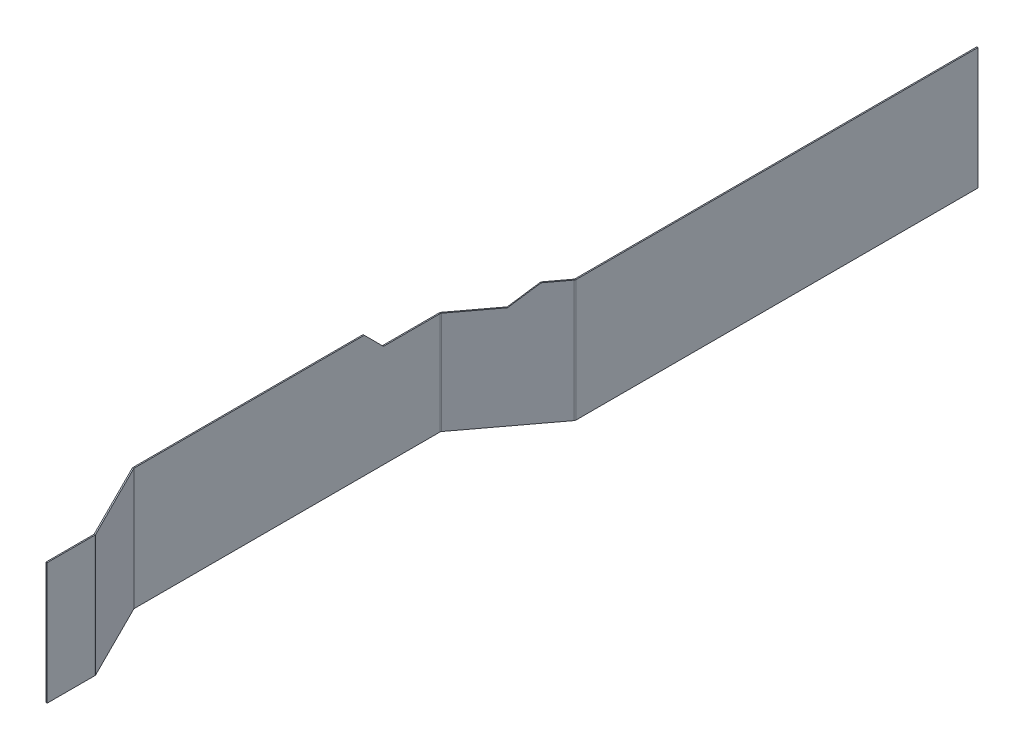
ISO-10303-21;
HEADER;
FILE_DESCRIPTION(('STEP AP214'),'2;1');
FILE_NAME('part.step','',(''),(''),'','','');
FILE_SCHEMA(('AUTOMOTIVE_DESIGN { 1 0 10303 214 1 1 1 1 }'));
ENDSEC;
DATA;
#1=APPLICATION_CONTEXT('core data for automotive mechanical design processes');
#2=APPLICATION_PROTOCOL_DEFINITION('international standard','automotive_design',2000,#1);
#3=PRODUCT_CONTEXT('',#1,'mechanical');
#4=PRODUCT('Part','Part','',(#3));
#5=PRODUCT_RELATED_PRODUCT_CATEGORY('part','',(#4));
#6=PRODUCT_DEFINITION_FORMATION('','',#4);
#7=PRODUCT_DEFINITION_CONTEXT('part definition',#1,'design');
#8=PRODUCT_DEFINITION('design','',#6,#7);
#9=PRODUCT_DEFINITION_SHAPE('','',#8);
#10=(LENGTH_UNIT() NAMED_UNIT(*) SI_UNIT(.MILLI.,.METRE.));
#11=(NAMED_UNIT(*) PLANE_ANGLE_UNIT() SI_UNIT($,.RADIAN.));
#12=(NAMED_UNIT(*) SI_UNIT($,.STERADIAN.) SOLID_ANGLE_UNIT());
#13=UNCERTAINTY_MEASURE_WITH_UNIT(LENGTH_MEASURE(1.E-05),#10,'distance_accuracy_value','');
#14=(GEOMETRIC_REPRESENTATION_CONTEXT(3) GLOBAL_UNCERTAINTY_ASSIGNED_CONTEXT((#13)) GLOBAL_UNIT_ASSIGNED_CONTEXT((#10,
#11,#12)) REPRESENTATION_CONTEXT('',''));
#15=CARTESIAN_POINT('',(0.,0.,0.));
#16=DIRECTION('',(0.,0.,1.));
#17=DIRECTION('',(1.,0.,0.));
#18=AXIS2_PLACEMENT_3D('',#15,#16,#17);
#19=CARTESIAN_POINT('',(-130.059115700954,162.314236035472,-50.1060746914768));
#20=DIRECTION('',(0.,1.,0.));
#21=DIRECTION('',(0.,0.,1.));
#22=AXIS2_PLACEMENT_3D('',#19,#20,#21);
#23=PLANE('',#22);
#24=DIRECTION('',(0.,0.,-1.));
#25=VECTOR('',#24,1.);
#26=CARTESIAN_POINT('',(-128.535115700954,162.314236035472,-50.1060746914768));
#27=LINE('',#26,#25);
#28=CARTESIAN_POINT('',(-128.535115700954,162.314236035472,-48.5820746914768));
#29=VERTEX_POINT('',#28);
#30=CARTESIAN_POINT('',(-128.535115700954,162.314236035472,482.625058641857));
#31=VERTEX_POINT('',#30);
#32=EDGE_CURVE('E200',#29,#31,#27,.F.);
#33=ORIENTED_EDGE('',*,*,#32,.F.);
#34=DIRECTION('',(-1.,0.,0.));
#35=VECTOR('',#34,1.);
#36=CARTESIAN_POINT('',(-130.059115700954,162.314236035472,-48.5820746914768));
#37=LINE('',#36,#35);
#38=CARTESIAN_POINT('',(-130.059115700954,162.314236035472,-48.5820746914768));
#39=VERTEX_POINT('',#38);
#40=EDGE_CURVE('E54',#29,#39,#37,.T.);
#41=ORIENTED_EDGE('',*,*,#40,.T.);
#42=DIRECTION('',(0.,0.,1.));
#43=VECTOR('',#42,1.);
#44=CARTESIAN_POINT('',(-130.059115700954,162.314236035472,-50.1060746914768));
#45=LINE('',#44,#43);
#46=CARTESIAN_POINT('',(-130.059115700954,162.314236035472,482.625058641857));
#47=VERTEX_POINT('',#46);
#48=EDGE_CURVE('E61',#39,#47,#45,.T.);
#49=ORIENTED_EDGE('',*,*,#48,.T.);
#50=DIRECTION('',(-1.,0.,0.));
#51=VECTOR('',#50,1.);
#52=CARTESIAN_POINT('',(-130.059115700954,162.314236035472,482.625058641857));
#53=LINE('',#52,#51);
#54=EDGE_CURVE('E265',#31,#47,#53,.T.);
#55=ORIENTED_EDGE('',*,*,#54,.F.);
#56=EDGE_LOOP('',(#33,#41,#49,#55));
#57=FACE_BOUND('',#56,.T.);
#58=ADVANCED_FACE('F39',(#57),#23,.T.);
#59=CARTESIAN_POINT('',(-130.059115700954,1.45603603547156,-50.1060746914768));
#60=DIRECTION('',(0.,1.,0.));
#61=DIRECTION('',(0.,0.,1.));
#62=AXIS2_PLACEMENT_3D('',#59,#60,#61);
#63=PLANE('',#62);
#64=DIRECTION('',(0.,0.,1.));
#65=VECTOR('',#64,1.);
#66=CARTESIAN_POINT('',(-130.059115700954,1.45603603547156,-50.1060746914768));
#67=LINE('',#66,#65);
#68=CARTESIAN_POINT('',(-130.059115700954,1.45603603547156,-48.5820746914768));
#69=VERTEX_POINT('',#68);
#70=CARTESIAN_POINT('',(-130.059115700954,1.45603603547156,482.625058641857));
#71=VERTEX_POINT('',#70);
#72=EDGE_CURVE('E417',#69,#71,#67,.T.);
#73=ORIENTED_EDGE('',*,*,#72,.F.);
#74=DIRECTION('',(-1.,0.,0.));
#75=VECTOR('',#74,1.);
#76=CARTESIAN_POINT('',(-130.059115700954,1.45603603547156,-48.5820746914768));
#77=LINE('',#76,#75);
#78=CARTESIAN_POINT('',(-128.535115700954,1.45603603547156,-48.5820746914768));
#79=VERTEX_POINT('',#78);
#80=EDGE_CURVE('E420',#69,#79,#77,.F.);
#81=ORIENTED_EDGE('',*,*,#80,.T.);
#82=DIRECTION('',(0.,0.,-1.));
#83=VECTOR('',#82,1.);
#84=CARTESIAN_POINT('',(-128.535115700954,1.45603603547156,-50.1060746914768));
#85=LINE('',#84,#83);
#86=CARTESIAN_POINT('',(-128.535115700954,1.45603603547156,482.625058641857));
#87=VERTEX_POINT('',#86);
#88=EDGE_CURVE('E212',#79,#87,#85,.F.);
#89=ORIENTED_EDGE('',*,*,#88,.T.);
#90=DIRECTION('',(-1.,0.,0.));
#91=VECTOR('',#90,1.);
#92=CARTESIAN_POINT('',(-130.059115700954,1.45603603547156,482.625058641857));
#93=LINE('',#92,#91);
#94=EDGE_CURVE('E262',#87,#71,#93,.T.);
#95=ORIENTED_EDGE('',*,*,#94,.T.);
#96=EDGE_LOOP('',(#73,#81,#89,#95));
#97=FACE_BOUND('',#96,.T.);
#98=ADVANCED_FACE('F414',(#97),#63,.F.);
#99=CARTESIAN_POINT('',(-130.059115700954,162.314236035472,-50.1060746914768));
#100=DIRECTION('',(1.,0.,0.));
#101=DIRECTION('',(0.,0.,-1.));
#102=AXIS2_PLACEMENT_3D('',#99,#100,#101);
#103=PLANE('',#102);
#104=DIRECTION('',(0.,1.,0.));
#105=VECTOR('',#104,1.);
#106=CARTESIAN_POINT('',(-130.059115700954,162.314236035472,-48.5820746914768));
#107=LINE('',#106,#105);
#108=EDGE_CURVE('E211',#69,#39,#107,.T.);
#109=ORIENTED_EDGE('',*,*,#108,.F.);
#110=ORIENTED_EDGE('',*,*,#72,.T.);
#111=DIRECTION('',(0.,-1.,0.));
#112=VECTOR('',#111,1.);
#113=CARTESIAN_POINT('',(-130.059115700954,162.314236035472,482.625058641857));
#114=LINE('',#113,#112);
#115=EDGE_CURVE('E151',#71,#47,#114,.F.);
#116=ORIENTED_EDGE('',*,*,#115,.T.);
#117=ORIENTED_EDGE('',*,*,#48,.F.);
#118=EDGE_LOOP('',(#109,#110,#116,#117));
#119=FACE_BOUND('',#118,.T.);
#120=ADVANCED_FACE('F557',(#119),#103,.F.);
#121=CARTESIAN_POINT('',(-128.535115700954,162.314236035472,-50.1060746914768));
#122=DIRECTION('',(1.,0.,0.));
#123=DIRECTION('',(0.,0.,-1.));
#124=AXIS2_PLACEMENT_3D('',#121,#122,#123);
#125=PLANE('',#124);
#126=ORIENTED_EDGE('',*,*,#88,.F.);
#127=DIRECTION('',(0.,1.,0.));
#128=VECTOR('',#127,1.);
#129=CARTESIAN_POINT('',(-128.535115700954,162.314236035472,-48.5820746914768));
#130=LINE('',#129,#128);
#131=EDGE_CURVE('E11',#79,#29,#130,.T.);
#132=ORIENTED_EDGE('',*,*,#131,.T.);
#133=ORIENTED_EDGE('',*,*,#32,.T.);
#134=DIRECTION('',(0.,1.,0.));
#135=VECTOR('',#134,1.);
#136=CARTESIAN_POINT('',(-128.535115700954,162.314236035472,482.625058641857));
#137=LINE('',#136,#135);
#138=EDGE_CURVE('E181',#87,#31,#137,.T.);
#139=ORIENTED_EDGE('',*,*,#138,.F.);
#140=EDGE_LOOP('',(#126,#132,#133,#139));
#141=FACE_BOUND('',#140,.T.);
#142=ADVANCED_FACE('F421',(#141),#125,.T.);
#143=CARTESIAN_POINT('',(-206.259115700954,162.314236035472,991.293925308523));
#144=DIRECTION('',(0.,1.,0.));
#145=DIRECTION('',(0.447213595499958,0.,0.894427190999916));
#146=AXIS2_PLACEMENT_3D('',#143,#144,#145);
#147=PLANE('',#146);
#148=DIRECTION('',(-0.894427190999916,0.,0.447213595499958));
#149=VECTOR('',#148,1.);
#150=CARTESIAN_POINT('',(-155.670958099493,162.314236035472,1092.47024051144));
#151=LINE('',#150,#149);
#152=CARTESIAN_POINT('',(-154.30785106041,162.314236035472,1091.7886869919));
#153=VERTEX_POINT('',#152);
#154=CARTESIAN_POINT('',(-155.670958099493,162.314236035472,1092.47024051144));
#155=VERTEX_POINT('',#154);
#156=EDGE_CURVE('E47',#153,#155,#151,.T.);
#157=ORIENTED_EDGE('',*,*,#156,.F.);
#158=DIRECTION('',(-0.447213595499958,0.,-0.894427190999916));
#159=VECTOR('',#158,1.);
#160=CARTESIAN_POINT('',(-204.89600866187,162.314236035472,990.612371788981));
#161=LINE('',#160,#159);
#162=CARTESIAN_POINT('',(-204.523273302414,162.314236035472,991.357842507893));
#163=VERTEX_POINT('',#162);
#164=EDGE_CURVE('E185',#163,#153,#161,.F.);
#165=ORIENTED_EDGE('',*,*,#164,.F.);
#166=DIRECTION('',(-0.894427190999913,0.,0.447213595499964));
#167=VECTOR('',#166,1.);
#168=CARTESIAN_POINT('',(-205.886380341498,162.314236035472,992.039396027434));
#169=LINE('',#168,#167);
#170=CARTESIAN_POINT('',(-205.886380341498,162.314236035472,992.039396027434));
#171=VERTEX_POINT('',#170);
#172=EDGE_CURVE('E291',#163,#171,#169,.T.);
#173=ORIENTED_EDGE('',*,*,#172,.T.);
#174=DIRECTION('',(0.447213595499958,0.,0.894427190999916));
#175=VECTOR('',#174,1.);
#176=CARTESIAN_POINT('',(-206.259115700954,162.314236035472,991.293925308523));
#177=LINE('',#176,#175);
#178=EDGE_CURVE('E314',#171,#155,#177,.T.);
#179=ORIENTED_EDGE('',*,*,#178,.T.);
#180=EDGE_LOOP('',(#157,#165,#173,#179));
#181=FACE_BOUND('',#180,.T.);
#182=ADVANCED_FACE('F315',(#181),#147,.T.);
#183=CARTESIAN_POINT('',(-202.728515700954,162.314236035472,990.460463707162));
#184=DIRECTION('',(0.,-1.,0.));
#185=DIRECTION('',(0.,0.,-1.));
#186=AXIS2_PLACEMENT_3D('',#183,#184,#185);
#187=PLANE('',#186);
#188=ORIENTED_EDGE('',*,*,#172,.F.);
#189=CARTESIAN_POINT('',(-202.728515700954,162.314236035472,990.460463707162));
#190=DIRECTION('',(0.,-1.,0.));
#191=DIRECTION('',(0.,0.,-1.));
#192=AXIS2_PLACEMENT_3D('',#189,#190,#191);
#193=CIRCLE('',#192,2.0066);
#194=CARTESIAN_POINT('',(-204.735115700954,162.314236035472,990.460463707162));
#195=VERTEX_POINT('',#194);
#196=EDGE_CURVE('E187',#163,#195,#193,.T.);
#197=ORIENTED_EDGE('',*,*,#196,.T.);
#198=DIRECTION('',(-1.,0.,0.));
#199=VECTOR('',#198,1.);
#200=CARTESIAN_POINT('',(-206.259115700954,162.314236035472,990.460463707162));
#201=LINE('',#200,#199);
#202=CARTESIAN_POINT('',(-206.259115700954,162.314236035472,990.460463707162));
#203=VERTEX_POINT('',#202);
#204=EDGE_CURVE('E288',#195,#203,#201,.T.);
#205=ORIENTED_EDGE('',*,*,#204,.T.);
#206=CARTESIAN_POINT('',(-202.728515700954,162.314236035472,990.460463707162));
#207=DIRECTION('',(0.,1.,0.));
#208=DIRECTION('',(0.,0.,1.));
#209=AXIS2_PLACEMENT_3D('',#206,#207,#208);
#210=CIRCLE('',#209,3.5306);
#211=EDGE_CURVE('E335',#171,#203,#210,.F.);
#212=ORIENTED_EDGE('',*,*,#211,.F.);
#213=EDGE_LOOP('',(#188,#197,#205,#212));
#214=FACE_BOUND('',#213,.T.);
#215=ADVANCED_FACE('F596',(#214),#187,.F.);
#216=CARTESIAN_POINT('',(-206.259115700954,162.314236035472,584.893925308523));
#217=DIRECTION('',(0.,1.,0.));
#218=DIRECTION('',(0.,0.,1.));
#219=AXIS2_PLACEMENT_3D('',#216,#217,#218);
#220=PLANE('',#219);
#221=ORIENTED_EDGE('',*,*,#204,.F.);
#222=DIRECTION('',(0.,0.,-1.));
#223=VECTOR('',#222,1.);
#224=CARTESIAN_POINT('',(-204.735115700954,162.314236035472,584.893925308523));
#225=LINE('',#224,#223);
#226=CARTESIAN_POINT('',(-204.735115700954,162.314236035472,686.493925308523));
#227=VERTEX_POINT('',#226);
#228=EDGE_CURVE('E199',#227,#195,#225,.F.);
#229=ORIENTED_EDGE('',*,*,#228,.F.);
#230=DIRECTION('',(-1.,0.,0.));
#231=VECTOR('',#230,1.);
#232=CARTESIAN_POINT('',(-206.259115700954,162.314236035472,686.493925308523));
#233=LINE('',#232,#231);
#234=CARTESIAN_POINT('',(-206.259115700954,162.314236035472,686.493925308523));
#235=VERTEX_POINT('',#234);
#236=EDGE_CURVE('E285',#227,#235,#233,.T.);
#237=ORIENTED_EDGE('',*,*,#236,.T.);
#238=DIRECTION('',(0.,0.,1.));
#239=VECTOR('',#238,1.);
#240=CARTESIAN_POINT('',(-206.259115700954,162.314236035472,584.893925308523));
#241=LINE('',#240,#239);
#242=EDGE_CURVE('E488',#235,#203,#241,.T.);
#243=ORIENTED_EDGE('',*,*,#242,.T.);
#244=EDGE_LOOP('',(#221,#229,#237,#243));
#245=FACE_BOUND('',#244,.T.);
#246=ADVANCED_FACE('F545',(#245),#220,.T.);
#247=CARTESIAN_POINT('',(-206.259115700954,194.278178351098,718.45786762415));
#248=DIRECTION('',(0.,-0.707106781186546,0.707106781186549));
#249=DIRECTION('',(0.,-0.707106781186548,-0.707106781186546));
#250=AXIS2_PLACEMENT_3D('',#247,#248,#249);
#251=PLANE('',#250);
#252=ORIENTED_EDGE('',*,*,#236,.F.);
#253=DIRECTION('',(0.,-0.707106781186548,-0.707106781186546));
#254=VECTOR('',#253,1.);
#255=CARTESIAN_POINT('',(-204.735115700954,194.278178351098,718.45786762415));
#256=LINE('',#255,#254);
#257=CARTESIAN_POINT('',(-204.735115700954,136.914236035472,661.093925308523));
#258=VERTEX_POINT('',#257);
#259=EDGE_CURVE('E229',#227,#258,#256,.T.);
#260=ORIENTED_EDGE('',*,*,#259,.T.);
#261=DIRECTION('',(-1.,0.,0.));
#262=VECTOR('',#261,1.);
#263=CARTESIAN_POINT('',(-206.259115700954,136.914236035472,661.093925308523));
#264=LINE('',#263,#262);
#265=CARTESIAN_POINT('',(-206.259115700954,136.914236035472,661.093925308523));
#266=VERTEX_POINT('',#265);
#267=EDGE_CURVE('E282',#258,#266,#264,.T.);
#268=ORIENTED_EDGE('',*,*,#267,.T.);
#269=DIRECTION('',(0.,-0.707106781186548,-0.707106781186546));
#270=VECTOR('',#269,1.);
#271=CARTESIAN_POINT('',(-206.259115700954,194.278178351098,718.45786762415));
#272=LINE('',#271,#270);
#273=EDGE_CURVE('E497',#235,#266,#272,.T.);
#274=ORIENTED_EDGE('',*,*,#273,.F.);
#275=EDGE_LOOP('',(#252,#260,#268,#274));
#276=FACE_BOUND('',#275,.T.);
#277=ADVANCED_FACE('F542',(#276),#251,.F.);
#278=CARTESIAN_POINT('',(-206.259115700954,136.914236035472,661.093925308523));
#279=DIRECTION('',(0.,-1.,0.));
#280=DIRECTION('',(0.,0.,-1.));
#281=AXIS2_PLACEMENT_3D('',#278,#279,#280);
#282=PLANE('',#281);
#283=ORIENTED_EDGE('',*,*,#267,.F.);
#284=DIRECTION('',(0.,0.,-1.));
#285=VECTOR('',#284,1.);
#286=CARTESIAN_POINT('',(-204.735115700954,136.914236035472,584.893925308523));
#287=LINE('',#286,#285);
#288=CARTESIAN_POINT('',(-204.735115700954,136.914236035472,586.07079197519));
#289=VERTEX_POINT('',#288);
#290=EDGE_CURVE('E191',#258,#289,#287,.T.);
#291=ORIENTED_EDGE('',*,*,#290,.T.);
#292=DIRECTION('',(-1.,0.,0.));
#293=VECTOR('',#292,1.);
#294=CARTESIAN_POINT('',(-206.259115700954,136.914236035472,586.07079197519));
#295=LINE('',#294,#293);
#296=CARTESIAN_POINT('',(-206.259115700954,136.914236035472,586.07079197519));
#297=VERTEX_POINT('',#296);
#298=EDGE_CURVE('E279',#289,#297,#295,.T.);
#299=ORIENTED_EDGE('',*,*,#298,.T.);
#300=DIRECTION('',(0.,0.,-1.));
#301=VECTOR('',#300,1.);
#302=CARTESIAN_POINT('',(-206.259115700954,136.914236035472,661.093925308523));
#303=LINE('',#302,#301);
#304=EDGE_CURVE('E494',#266,#297,#303,.T.);
#305=ORIENTED_EDGE('',*,*,#304,.F.);
#306=EDGE_LOOP('',(#283,#291,#299,#305));
#307=FACE_BOUND('',#306,.T.);
#308=ADVANCED_FACE('F538',(#307),#282,.F.);
#309=CARTESIAN_POINT('',(-202.728515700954,136.914236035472,586.07079197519));
#310=DIRECTION('',(0.,-1.,0.));
#311=DIRECTION('',(0.,0.,-1.));
#312=AXIS2_PLACEMENT_3D('',#309,#310,#311);
#313=PLANE('',#312);
#314=ORIENTED_EDGE('',*,*,#298,.F.);
#315=CARTESIAN_POINT('',(-202.728515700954,136.914236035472,586.07079197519));
#316=DIRECTION('',(0.,-1.,0.));
#317=DIRECTION('',(0.,0.,-1.));
#318=AXIS2_PLACEMENT_3D('',#315,#316,#317);
#319=CIRCLE('',#318,2.0066);
#320=CARTESIAN_POINT('',(-204.333795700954,136.914236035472,584.86683197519));
#321=VERTEX_POINT('',#320);
#322=EDGE_CURVE('E195',#289,#321,#319,.T.);
#323=ORIENTED_EDGE('',*,*,#322,.T.);
#324=DIRECTION('',(-0.8,0.,-0.6));
#325=VECTOR('',#324,1.);
#326=CARTESIAN_POINT('',(-205.552995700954,136.914236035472,583.95243197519));
#327=LINE('',#326,#325);
#328=CARTESIAN_POINT('',(-205.552995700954,136.914236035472,583.95243197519));
#329=VERTEX_POINT('',#328);
#330=EDGE_CURVE('E276',#321,#329,#327,.T.);
#331=ORIENTED_EDGE('',*,*,#330,.T.);
#332=CARTESIAN_POINT('',(-202.728515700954,136.914236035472,586.07079197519));
#333=DIRECTION('',(0.,1.,0.));
#334=DIRECTION('',(0.,0.,1.));
#335=AXIS2_PLACEMENT_3D('',#332,#333,#334);
#336=CIRCLE('',#335,3.5306);
#337=EDGE_CURVE('E343',#297,#329,#336,.F.);
#338=ORIENTED_EDGE('',*,*,#337,.F.);
#339=EDGE_LOOP('',(#314,#323,#331,#338));
#340=FACE_BOUND('',#339,.T.);
#341=ADVANCED_FACE('F458',(#340),#313,.F.);
#342=CARTESIAN_POINT('',(-130.059115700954,136.914236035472,483.293925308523));
#343=DIRECTION('',(0.,-1.,0.));
#344=DIRECTION('',(0.6,0.,-0.8));
#345=AXIS2_PLACEMENT_3D('',#342,#343,#344);
#346=PLANE('',#345);
#347=ORIENTED_EDGE('',*,*,#330,.F.);
#348=DIRECTION('',(0.6,0.,-0.8));
#349=VECTOR('',#348,1.);
#350=CARTESIAN_POINT('',(-128.839915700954,136.914236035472,484.208325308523));
#351=LINE('',#350,#349);
#352=CARTESIAN_POINT('',(-166.939915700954,136.914236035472,535.008325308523));
#353=VERTEX_POINT('',#352);
#354=EDGE_CURVE('E207',#321,#353,#351,.T.);
#355=ORIENTED_EDGE('',*,*,#354,.T.);
#356=DIRECTION('',(-0.8,0.,-0.6));
#357=VECTOR('',#356,1.);
#358=CARTESIAN_POINT('',(-168.159115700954,136.914236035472,534.093925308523));
#359=LINE('',#358,#357);
#360=CARTESIAN_POINT('',(-168.159115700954,136.914236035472,534.093925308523));
#361=VERTEX_POINT('',#360);
#362=EDGE_CURVE('E273',#353,#361,#359,.T.);
#363=ORIENTED_EDGE('',*,*,#362,.T.);
#364=DIRECTION('',(0.6,0.,-0.8));
#365=VECTOR('',#364,1.);
#366=CARTESIAN_POINT('',(-130.059115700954,136.914236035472,483.293925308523));
#367=LINE('',#366,#365);
#368=EDGE_CURVE('E467',#329,#361,#367,.T.);
#369=ORIENTED_EDGE('',*,*,#368,.F.);
#370=EDGE_LOOP('',(#347,#355,#363,#369));
#371=FACE_BOUND('',#370,.T.);
#372=ADVANCED_FACE('F468',(#371),#346,.F.);
#373=CARTESIAN_POINT('',(-137.493262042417,177.80204091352,493.206120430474));
#374=DIRECTION('',(0.374817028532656,-0.780868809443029,-0.499756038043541));
#375=DIRECTION('',(0.468521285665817,0.624695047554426,-0.624695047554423));
#376=AXIS2_PLACEMENT_3D('',#373,#374,#375);
#377=PLANE('',#376);
#378=ORIENTED_EDGE('',*,*,#362,.F.);
#379=DIRECTION('',(0.468521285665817,0.624695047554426,-0.624695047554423));
#380=VECTOR('',#379,1.);
#381=CARTESIAN_POINT('',(-136.274062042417,177.80204091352,494.120520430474));
#382=LINE('',#381,#380);
#383=CARTESIAN_POINT('',(-147.889915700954,162.314236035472,509.608325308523));
#384=VERTEX_POINT('',#383);
#385=EDGE_CURVE('E220',#353,#384,#382,.T.);
#386=ORIENTED_EDGE('',*,*,#385,.T.);
#387=DIRECTION('',(-0.8,0.,-0.6));
#388=VECTOR('',#387,1.);
#389=CARTESIAN_POINT('',(-149.109115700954,162.314236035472,508.693925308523));
#390=LINE('',#389,#388);
#391=CARTESIAN_POINT('',(-149.109115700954,162.314236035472,508.693925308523));
#392=VERTEX_POINT('',#391);
#393=EDGE_CURVE('E270',#384,#392,#390,.T.);
#394=ORIENTED_EDGE('',*,*,#393,.T.);
#395=DIRECTION('',(0.468521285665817,0.624695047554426,-0.624695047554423));
#396=VECTOR('',#395,1.);
#397=CARTESIAN_POINT('',(-137.493262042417,177.80204091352,493.206120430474));
#398=LINE('',#397,#396);
#399=EDGE_CURVE('E472',#361,#392,#398,.T.);
#400=ORIENTED_EDGE('',*,*,#399,.F.);
#401=EDGE_LOOP('',(#378,#386,#394,#400));
#402=FACE_BOUND('',#401,.T.);
#403=ADVANCED_FACE('F582',(#402),#377,.F.);
#404=CARTESIAN_POINT('',(-130.059115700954,162.314236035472,483.293925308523));
#405=DIRECTION('',(0.,1.,0.));
#406=DIRECTION('',(-0.6,0.,0.8));
#407=AXIS2_PLACEMENT_3D('',#404,#405,#406);
#408=PLANE('',#407);
#409=ORIENTED_EDGE('',*,*,#393,.F.);
#410=DIRECTION('',(0.6,0.,-0.8));
#411=VECTOR('',#410,1.);
#412=CARTESIAN_POINT('',(-128.839915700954,162.314236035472,484.208325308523));
#413=LINE('',#412,#411);
#414=CARTESIAN_POINT('',(-129.241235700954,162.314236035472,484.743418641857));
#415=VERTEX_POINT('',#414);
#416=EDGE_CURVE('E214',#415,#384,#413,.F.);
#417=ORIENTED_EDGE('',*,*,#416,.F.);
#418=DIRECTION('',(-0.799999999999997,0.,-0.600000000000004));
#419=VECTOR('',#418,1.);
#420=CARTESIAN_POINT('',(-130.460435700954,162.314236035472,483.829018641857));
#421=LINE('',#420,#419);
#422=CARTESIAN_POINT('',(-130.460435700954,162.314236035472,483.829018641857));
#423=VERTEX_POINT('',#422);
#424=EDGE_CURVE('E267',#415,#423,#421,.T.);
#425=ORIENTED_EDGE('',*,*,#424,.T.);
#426=DIRECTION('',(-0.6,0.,0.8));
#427=VECTOR('',#426,1.);
#428=CARTESIAN_POINT('',(-130.059115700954,162.314236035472,483.293925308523));
#429=LINE('',#428,#427);
#430=EDGE_CURVE('E550',#423,#392,#429,.T.);
#431=ORIENTED_EDGE('',*,*,#430,.T.);
#432=EDGE_LOOP('',(#409,#417,#425,#431));
#433=FACE_BOUND('',#432,.T.);
#434=ADVANCED_FACE('F579',(#433),#408,.T.);
#435=CARTESIAN_POINT('',(-132.065715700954,162.314236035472,482.625058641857));
#436=DIRECTION('',(0.,1.,0.));
#437=DIRECTION('',(0.,0.,1.));
#438=AXIS2_PLACEMENT_3D('',#435,#436,#437);
#439=PLANE('',#438);
#440=ORIENTED_EDGE('',*,*,#424,.F.);
#441=CARTESIAN_POINT('',(-132.065715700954,162.314236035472,482.625058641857));
#442=DIRECTION('',(0.,1.,0.));
#443=DIRECTION('',(0.,0.,1.));
#444=AXIS2_PLACEMENT_3D('',#441,#442,#443);
#445=CIRCLE('',#444,3.5306);
#446=EDGE_CURVE('E204',#415,#31,#445,.T.);
#447=ORIENTED_EDGE('',*,*,#446,.T.);
#448=ORIENTED_EDGE('',*,*,#54,.T.);
#449=CARTESIAN_POINT('',(-132.065715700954,162.314236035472,482.625058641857));
#450=DIRECTION('',(0.,-1.,0.));
#451=DIRECTION('',(0.,0.,-1.));
#452=AXIS2_PLACEMENT_3D('',#449,#450,#451);
#453=CIRCLE('',#452,2.0066);
#454=EDGE_CURVE('E355',#423,#47,#453,.F.);
#455=ORIENTED_EDGE('',*,*,#454,.F.);
#456=EDGE_LOOP('',(#440,#447,#448,#455));
#457=FACE_BOUND('',#456,.T.);
#458=ADVANCED_FACE('F393',(#457),#439,.T.);
#459=CARTESIAN_POINT('',(-132.065715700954,1.45603603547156,482.625058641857));
#460=DIRECTION('',(0.,-1.,0.));
#461=DIRECTION('',(0.,0.,-1.));
#462=AXIS2_PLACEMENT_3D('',#459,#460,#461);
#463=PLANE('',#462);
#464=ORIENTED_EDGE('',*,*,#94,.F.);
#465=CARTESIAN_POINT('',(-132.065715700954,1.45603603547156,482.625058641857));
#466=DIRECTION('',(0.,1.,0.));
#467=DIRECTION('',(0.,0.,1.));
#468=AXIS2_PLACEMENT_3D('',#465,#466,#467);
#469=CIRCLE('',#468,3.5306);
#470=CARTESIAN_POINT('',(-129.241235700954,1.45603603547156,484.743418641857));
#471=VERTEX_POINT('',#470);
#472=EDGE_CURVE('E208',#87,#471,#469,.F.);
#473=ORIENTED_EDGE('',*,*,#472,.T.);
#474=DIRECTION('',(-0.8,0.,-0.6));
#475=VECTOR('',#474,1.);
#476=CARTESIAN_POINT('',(-130.460435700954,1.45603603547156,483.829018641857));
#477=LINE('',#476,#475);
#478=CARTESIAN_POINT('',(-130.460435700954,1.45603603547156,483.829018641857));
#479=VERTEX_POINT('',#478);
#480=EDGE_CURVE('E259',#471,#479,#477,.T.);
#481=ORIENTED_EDGE('',*,*,#480,.T.);
#482=CARTESIAN_POINT('',(-132.065715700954,1.45603603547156,482.625058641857));
#483=DIRECTION('',(0.,1.,0.));
#484=DIRECTION('',(0.,0.,1.));
#485=AXIS2_PLACEMENT_3D('',#482,#483,#484);
#486=CIRCLE('',#485,2.0066);
#487=EDGE_CURVE('E362',#71,#479,#486,.F.);
#488=ORIENTED_EDGE('',*,*,#487,.F.);
#489=EDGE_LOOP('',(#464,#473,#481,#488));
#490=FACE_BOUND('',#489,.T.);
#491=ADVANCED_FACE('F408',(#490),#463,.T.);
#492=CARTESIAN_POINT('',(-130.059115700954,1.45603603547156,483.293925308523));
#493=DIRECTION('',(0.,1.,0.));
#494=DIRECTION('',(-0.6,0.,0.8));
#495=AXIS2_PLACEMENT_3D('',#492,#493,#494);
#496=PLANE('',#495);
#497=ORIENTED_EDGE('',*,*,#480,.F.);
#498=DIRECTION('',(0.6,0.,-0.8));
#499=VECTOR('',#498,1.);
#500=CARTESIAN_POINT('',(-128.839915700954,1.45603603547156,484.208325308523));
#501=LINE('',#500,#499);
#502=CARTESIAN_POINT('',(-204.333795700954,1.45603603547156,584.86683197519));
#503=VERTEX_POINT('',#502);
#504=EDGE_CURVE('E171',#471,#503,#501,.F.);
#505=ORIENTED_EDGE('',*,*,#504,.T.);
#506=DIRECTION('',(-0.800000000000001,0.,-0.599999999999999));
#507=VECTOR('',#506,1.);
#508=CARTESIAN_POINT('',(-205.552995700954,1.45603603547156,583.95243197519));
#509=LINE('',#508,#507);
#510=CARTESIAN_POINT('',(-205.552995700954,1.45603603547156,583.95243197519));
#511=VERTEX_POINT('',#510);
#512=EDGE_CURVE('E256',#503,#511,#509,.T.);
#513=ORIENTED_EDGE('',*,*,#512,.T.);
#514=DIRECTION('',(-0.6,0.,0.8));
#515=VECTOR('',#514,1.);
#516=CARTESIAN_POINT('',(-130.059115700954,1.45603603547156,483.293925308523));
#517=LINE('',#516,#515);
#518=EDGE_CURVE('E310',#479,#511,#517,.T.);
#519=ORIENTED_EDGE('',*,*,#518,.F.);
#520=EDGE_LOOP('',(#497,#505,#513,#519));
#521=FACE_BOUND('',#520,.T.);
#522=ADVANCED_FACE('F638',(#521),#496,.F.);
#523=CARTESIAN_POINT('',(-202.728515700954,1.45603603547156,586.07079197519));
#524=DIRECTION('',(0.,1.,0.));
#525=DIRECTION('',(0.,0.,1.));
#526=AXIS2_PLACEMENT_3D('',#523,#524,#525);
#527=PLANE('',#526);
#528=ORIENTED_EDGE('',*,*,#512,.F.);
#529=CARTESIAN_POINT('',(-202.728515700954,1.45603603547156,586.07079197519));
#530=DIRECTION('',(0.,-1.,0.));
#531=DIRECTION('',(0.,0.,-1.));
#532=AXIS2_PLACEMENT_3D('',#529,#530,#531);
#533=CIRCLE('',#532,2.0066);
#534=CARTESIAN_POINT('',(-204.735115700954,1.45603603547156,586.07079197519));
#535=VERTEX_POINT('',#534);
#536=EDGE_CURVE('E201',#503,#535,#533,.F.);
#537=ORIENTED_EDGE('',*,*,#536,.T.);
#538=DIRECTION('',(-1.,0.,0.));
#539=VECTOR('',#538,1.);
#540=CARTESIAN_POINT('',(-206.259115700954,1.45603603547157,586.07079197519));
#541=LINE('',#540,#539);
#542=CARTESIAN_POINT('',(-206.259115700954,1.45603603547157,586.07079197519));
#543=VERTEX_POINT('',#542);
#544=EDGE_CURVE('E253',#535,#543,#541,.T.);
#545=ORIENTED_EDGE('',*,*,#544,.T.);
#546=CARTESIAN_POINT('',(-202.728515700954,1.45603603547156,586.07079197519));
#547=DIRECTION('',(0.,-1.,0.));
#548=DIRECTION('',(0.,0.,-1.));
#549=AXIS2_PLACEMENT_3D('',#546,#547,#548);
#550=CIRCLE('',#549,3.5306);
#551=EDGE_CURVE('E352',#511,#543,#550,.F.);
#552=ORIENTED_EDGE('',*,*,#551,.F.);
#553=EDGE_LOOP('',(#528,#537,#545,#552));
#554=FACE_BOUND('',#553,.T.);
#555=ADVANCED_FACE('F480',(#554),#527,.F.);
#556=CARTESIAN_POINT('',(-206.259115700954,1.45603603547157,-50.1060746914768));
#557=DIRECTION('',(0.,1.,0.));
#558=DIRECTION('',(0.,0.,1.));
#559=AXIS2_PLACEMENT_3D('',#556,#557,#558);
#560=PLANE('',#559);
#561=ORIENTED_EDGE('',*,*,#544,.F.);
#562=DIRECTION('',(0.,0.,-1.));
#563=VECTOR('',#562,1.);
#564=CARTESIAN_POINT('',(-204.735115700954,1.45603603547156,584.893925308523));
#565=LINE('',#564,#563);
#566=CARTESIAN_POINT('',(-204.735115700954,1.45603603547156,990.460463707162));
#567=VERTEX_POINT('',#566);
#568=EDGE_CURVE('E196',#535,#567,#565,.F.);
#569=ORIENTED_EDGE('',*,*,#568,.T.);
#570=DIRECTION('',(-1.,0.,0.));
#571=VECTOR('',#570,1.);
#572=CARTESIAN_POINT('',(-206.259115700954,1.45603603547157,990.460463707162));
#573=LINE('',#572,#571);
#574=CARTESIAN_POINT('',(-206.259115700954,1.45603603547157,990.460463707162));
#575=VERTEX_POINT('',#574);
#576=EDGE_CURVE('E250',#567,#575,#573,.T.);
#577=ORIENTED_EDGE('',*,*,#576,.T.);
#578=DIRECTION('',(0.,0.,1.));
#579=VECTOR('',#578,1.);
#580=CARTESIAN_POINT('',(-206.259115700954,1.45603603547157,-50.1060746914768));
#581=LINE('',#580,#579);
#582=EDGE_CURVE('E484',#543,#575,#581,.T.);
#583=ORIENTED_EDGE('',*,*,#582,.F.);
#584=EDGE_LOOP('',(#561,#569,#577,#583));
#585=FACE_BOUND('',#584,.T.);
#586=ADVANCED_FACE('F485',(#585),#560,.F.);
#587=CARTESIAN_POINT('',(-202.728515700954,1.45603603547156,990.460463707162));
#588=DIRECTION('',(0.,1.,0.));
#589=DIRECTION('',(0.,0.,1.));
#590=AXIS2_PLACEMENT_3D('',#587,#588,#589);
#591=PLANE('',#590);
#592=ORIENTED_EDGE('',*,*,#576,.F.);
#593=CARTESIAN_POINT('',(-202.728515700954,1.45603603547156,990.460463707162));
#594=DIRECTION('',(0.,-1.,0.));
#595=DIRECTION('',(0.,0.,-1.));
#596=AXIS2_PLACEMENT_3D('',#593,#594,#595);
#597=CIRCLE('',#596,2.0066);
#598=CARTESIAN_POINT('',(-204.523273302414,1.45603603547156,991.357842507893));
#599=VERTEX_POINT('',#598);
#600=EDGE_CURVE('E192',#567,#599,#597,.F.);
#601=ORIENTED_EDGE('',*,*,#600,.T.);
#602=DIRECTION('',(-0.894427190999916,0.,0.447213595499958));
#603=VECTOR('',#602,1.);
#604=CARTESIAN_POINT('',(-205.886380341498,1.45603603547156,992.039396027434));
#605=LINE('',#604,#603);
#606=CARTESIAN_POINT('',(-205.886380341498,1.45603603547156,992.039396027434));
#607=VERTEX_POINT('',#606);
#608=EDGE_CURVE('E247',#599,#607,#605,.T.);
#609=ORIENTED_EDGE('',*,*,#608,.T.);
#610=CARTESIAN_POINT('',(-202.728515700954,1.45603603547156,990.460463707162));
#611=DIRECTION('',(0.,-1.,0.));
#612=DIRECTION('',(0.,0.,-1.));
#613=AXIS2_PLACEMENT_3D('',#610,#611,#612);
#614=CIRCLE('',#613,3.5306);
#615=EDGE_CURVE('E340',#575,#607,#614,.F.);
#616=ORIENTED_EDGE('',*,*,#615,.F.);
#617=EDGE_LOOP('',(#592,#601,#609,#616));
#618=FACE_BOUND('',#617,.T.);
#619=ADVANCED_FACE('F527',(#618),#591,.F.);
#620=CARTESIAN_POINT('',(-206.259115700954,1.45603603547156,991.293925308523));
#621=DIRECTION('',(0.,1.,0.));
#622=DIRECTION('',(0.447213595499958,0.,0.894427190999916));
#623=AXIS2_PLACEMENT_3D('',#620,#621,#622);
#624=PLANE('',#623);
#625=ORIENTED_EDGE('',*,*,#608,.F.);
#626=DIRECTION('',(-0.447213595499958,0.,-0.894427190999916));
#627=VECTOR('',#626,1.);
#628=CARTESIAN_POINT('',(-204.89600866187,1.45603603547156,990.612371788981));
#629=LINE('',#628,#627);
#630=CARTESIAN_POINT('',(-154.30785106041,1.45603603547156,1091.7886869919));
#631=VERTEX_POINT('',#630);
#632=EDGE_CURVE('E188',#599,#631,#629,.F.);
#633=ORIENTED_EDGE('',*,*,#632,.T.);
#634=DIRECTION('',(-0.894427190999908,0.,0.447213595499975));
#635=VECTOR('',#634,1.);
#636=CARTESIAN_POINT('',(-155.670958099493,1.45603603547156,1092.47024051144));
#637=LINE('',#636,#635);
#638=CARTESIAN_POINT('',(-155.670958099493,1.45603603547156,1092.47024051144));
#639=VERTEX_POINT('',#638);
#640=EDGE_CURVE('E244',#631,#639,#637,.T.);
#641=ORIENTED_EDGE('',*,*,#640,.T.);
#642=DIRECTION('',(0.447213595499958,0.,0.894427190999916));
#643=VECTOR('',#642,1.);
#644=CARTESIAN_POINT('',(-206.259115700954,1.45603603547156,991.293925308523));
#645=LINE('',#644,#643);
#646=EDGE_CURVE('E321',#607,#639,#645,.T.);
#647=ORIENTED_EDGE('',*,*,#646,.F.);
#648=EDGE_LOOP('',(#625,#633,#641,#647));
#649=FACE_BOUND('',#648,.T.);
#650=ADVANCED_FACE('F520',(#649),#624,.F.);
#651=CARTESIAN_POINT('',(-157.465715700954,1.45603603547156,1093.36761931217));
#652=DIRECTION('',(0.,-1.,0.));
#653=DIRECTION('',(0.,0.,-1.));
#654=AXIS2_PLACEMENT_3D('',#651,#652,#653);
#655=PLANE('',#654);
#656=ORIENTED_EDGE('',*,*,#640,.F.);
#657=CARTESIAN_POINT('',(-157.465715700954,1.45603603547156,1093.36761931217));
#658=DIRECTION('',(0.,1.,0.));
#659=DIRECTION('',(0.,0.,1.));
#660=AXIS2_PLACEMENT_3D('',#657,#658,#659);
#661=CIRCLE('',#660,3.5306);
#662=CARTESIAN_POINT('',(-153.935115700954,1.45603603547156,1093.36761931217));
#663=VERTEX_POINT('',#662);
#664=EDGE_CURVE('E172',#631,#663,#661,.F.);
#665=ORIENTED_EDGE('',*,*,#664,.T.);
#666=DIRECTION('',(-1.,0.,0.));
#667=VECTOR('',#666,1.);
#668=CARTESIAN_POINT('',(-155.459115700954,1.45603603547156,1093.36761931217));
#669=LINE('',#668,#667);
#670=CARTESIAN_POINT('',(-155.459115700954,1.45603603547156,1093.36761931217));
#671=VERTEX_POINT('',#670);
#672=EDGE_CURVE('E241',#663,#671,#669,.T.);
#673=ORIENTED_EDGE('',*,*,#672,.T.);
#674=CARTESIAN_POINT('',(-157.465715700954,1.45603603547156,1093.36761931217));
#675=DIRECTION('',(0.,1.,0.));
#676=DIRECTION('',(0.,0.,1.));
#677=AXIS2_PLACEMENT_3D('',#674,#675,#676);
#678=CIRCLE('',#677,2.0066);
#679=EDGE_CURVE('E311',#639,#671,#678,.F.);
#680=ORIENTED_EDGE('',*,*,#679,.F.);
#681=EDGE_LOOP('',(#656,#665,#673,#680));
#682=FACE_BOUND('',#681,.T.);
#683=ADVANCED_FACE('F517',(#682),#655,.T.);
#684=CARTESIAN_POINT('',(-155.459115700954,1.45603603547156,1092.89392530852));
#685=DIRECTION('',(0.,1.,0.));
#686=DIRECTION('',(0.,0.,1.));
#687=AXIS2_PLACEMENT_3D('',#684,#685,#686);
#688=PLANE('',#687);
#689=ORIENTED_EDGE('',*,*,#672,.F.);
#690=DIRECTION('',(0.,0.,-1.));
#691=VECTOR('',#690,1.);
#692=CARTESIAN_POINT('',(-153.935115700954,1.45603603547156,1092.89392530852));
#693=LINE('',#692,#691);
#694=CARTESIAN_POINT('',(-153.935115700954,1.45603603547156,1156.39392530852));
#695=VERTEX_POINT('',#694);
#696=EDGE_CURVE('E161',#663,#695,#693,.F.);
#697=ORIENTED_EDGE('',*,*,#696,.T.);
#698=DIRECTION('',(-1.,0.,0.));
#699=VECTOR('',#698,1.);
#700=CARTESIAN_POINT('',(-155.459115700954,1.45603603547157,1156.39392530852));
#701=LINE('',#700,#699);
#702=CARTESIAN_POINT('',(-155.459115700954,1.45603603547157,1156.39392530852));
#703=VERTEX_POINT('',#702);
#704=EDGE_CURVE('E238',#695,#703,#701,.T.);
#705=ORIENTED_EDGE('',*,*,#704,.T.);
#706=DIRECTION('',(0.,0.,1.));
#707=VECTOR('',#706,1.);
#708=CARTESIAN_POINT('',(-155.459115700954,1.45603603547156,1092.89392530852));
#709=LINE('',#708,#707);
#710=EDGE_CURVE('E320',#671,#703,#709,.T.);
#711=ORIENTED_EDGE('',*,*,#710,.F.);
#712=EDGE_LOOP('',(#689,#697,#705,#711));
#713=FACE_BOUND('',#712,.T.);
#714=ADVANCED_FACE('F515',(#713),#688,.F.);
#715=CARTESIAN_POINT('',(-155.459115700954,162.314236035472,1156.39392530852));
#716=DIRECTION('',(0.,0.,1.));
#717=DIRECTION('',(0.,-1.,0.));
#718=AXIS2_PLACEMENT_3D('',#715,#716,#717);
#719=PLANE('',#718);
#720=ORIENTED_EDGE('',*,*,#704,.F.);
#721=DIRECTION('',(0.,1.,0.));
#722=VECTOR('',#721,1.);
#723=CARTESIAN_POINT('',(-153.935115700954,162.314236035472,1156.39392530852));
#724=LINE('',#723,#722);
#725=CARTESIAN_POINT('',(-153.935115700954,162.314236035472,1156.39392530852));
#726=VERTEX_POINT('',#725);
#727=EDGE_CURVE('E177',#726,#695,#724,.F.);
#728=ORIENTED_EDGE('',*,*,#727,.F.);
#729=DIRECTION('',(-1.,0.,0.));
#730=VECTOR('',#729,1.);
#731=CARTESIAN_POINT('',(-155.459115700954,162.314236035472,1156.39392530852));
#732=LINE('',#731,#730);
#733=CARTESIAN_POINT('',(-155.459115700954,162.314236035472,1156.39392530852));
#734=VERTEX_POINT('',#733);
#735=EDGE_CURVE('E150',#726,#734,#732,.T.);
#736=ORIENTED_EDGE('',*,*,#735,.T.);
#737=DIRECTION('',(0.,-1.,0.));
#738=VECTOR('',#737,1.);
#739=CARTESIAN_POINT('',(-155.459115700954,162.314236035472,1156.39392530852));
#740=LINE('',#739,#738);
#741=EDGE_CURVE('E506',#734,#703,#740,.T.);
#742=ORIENTED_EDGE('',*,*,#741,.T.);
#743=EDGE_LOOP('',(#720,#728,#736,#742));
#744=FACE_BOUND('',#743,.T.);
#745=ADVANCED_FACE('F513',(#744),#719,.T.);
#746=CARTESIAN_POINT('',(-155.459115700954,162.314236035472,1092.89392530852));
#747=DIRECTION('',(0.,1.,0.));
#748=DIRECTION('',(0.,0.,1.));
#749=AXIS2_PLACEMENT_3D('',#746,#747,#748);
#750=PLANE('',#749);
#751=ORIENTED_EDGE('',*,*,#735,.F.);
#752=DIRECTION('',(0.,0.,-1.));
#753=VECTOR('',#752,1.);
#754=CARTESIAN_POINT('',(-153.935115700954,162.314236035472,1092.89392530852));
#755=LINE('',#754,#753);
#756=CARTESIAN_POINT('',(-153.935115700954,162.314236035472,1093.36761931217));
#757=VERTEX_POINT('',#756);
#758=EDGE_CURVE('E159',#757,#726,#755,.F.);
#759=ORIENTED_EDGE('',*,*,#758,.F.);
#760=DIRECTION('',(-1.,0.,0.));
#761=VECTOR('',#760,1.);
#762=CARTESIAN_POINT('',(-155.459115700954,162.314236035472,1093.36761931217));
#763=LINE('',#762,#761);
#764=CARTESIAN_POINT('',(-155.459115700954,162.314236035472,1093.36761931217));
#765=VERTEX_POINT('',#764);
#766=EDGE_CURVE('E138',#757,#765,#763,.T.);
#767=ORIENTED_EDGE('',*,*,#766,.T.);
#768=DIRECTION('',(0.,0.,1.));
#769=VECTOR('',#768,1.);
#770=CARTESIAN_POINT('',(-155.459115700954,162.314236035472,1092.89392530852));
#771=LINE('',#770,#769);
#772=EDGE_CURVE('E331',#765,#734,#771,.T.);
#773=ORIENTED_EDGE('',*,*,#772,.T.);
#774=EDGE_LOOP('',(#751,#759,#767,#773));
#775=FACE_BOUND('',#774,.T.);
#776=ADVANCED_FACE('F174',(#775),#750,.T.);
#777=CARTESIAN_POINT('',(-157.465715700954,162.314236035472,1093.36761931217));
#778=DIRECTION('',(0.,1.,0.));
#779=DIRECTION('',(0.,0.,1.));
#780=AXIS2_PLACEMENT_3D('',#777,#778,#779);
#781=PLANE('',#780);
#782=CARTESIAN_POINT('',(-157.465715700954,162.314236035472,1093.36761931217));
#783=DIRECTION('',(0.,1.,0.));
#784=DIRECTION('',(0.,0.,1.));
#785=AXIS2_PLACEMENT_3D('',#782,#783,#784);
#786=CIRCLE('',#785,3.5306);
#787=EDGE_CURVE('E142',#757,#153,#786,.T.);
#788=ORIENTED_EDGE('',*,*,#787,.T.);
#789=ORIENTED_EDGE('',*,*,#156,.T.);
#790=CARTESIAN_POINT('',(-157.465715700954,162.314236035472,1093.36761931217));
#791=DIRECTION('',(0.,-1.,0.));
#792=DIRECTION('',(0.,0.,-1.));
#793=AXIS2_PLACEMENT_3D('',#790,#791,#792);
#794=CIRCLE('',#793,2.0066);
#795=EDGE_CURVE('E145',#765,#155,#794,.F.);
#796=ORIENTED_EDGE('',*,*,#795,.F.);
#797=ORIENTED_EDGE('',*,*,#766,.F.);
#798=EDGE_LOOP('',(#788,#789,#796,#797));
#799=FACE_BOUND('',#798,.T.);
#800=ADVANCED_FACE('F41',(#799),#781,.T.);
#801=CARTESIAN_POINT('',(-155.459115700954,162.314236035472,1092.89392530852));
#802=DIRECTION('',(1.,0.,0.));
#803=DIRECTION('',(0.,0.,-1.));
#804=AXIS2_PLACEMENT_3D('',#801,#802,#803);
#805=PLANE('',#804);
#806=ORIENTED_EDGE('',*,*,#772,.F.);
#807=DIRECTION('',(0.,-1.,0.));
#808=VECTOR('',#807,1.);
#809=CARTESIAN_POINT('',(-155.459115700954,1.45603603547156,1093.36761931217));
#810=LINE('',#809,#808);
#811=EDGE_CURVE('E309',#765,#671,#810,.T.);
#812=ORIENTED_EDGE('',*,*,#811,.T.);
#813=ORIENTED_EDGE('',*,*,#710,.T.);
#814=ORIENTED_EDGE('',*,*,#741,.F.);
#815=EDGE_LOOP('',(#806,#812,#813,#814));
#816=FACE_BOUND('',#815,.T.);
#817=ADVANCED_FACE('F510',(#816),#805,.F.);
#818=CARTESIAN_POINT('',(-206.259115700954,162.314236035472,991.293925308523));
#819=DIRECTION('',(0.894427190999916,0.,-0.447213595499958));
#820=DIRECTION('',(-0.447213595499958,0.,-0.894427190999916));
#821=AXIS2_PLACEMENT_3D('',#818,#819,#820);
#822=PLANE('',#821);
#823=ORIENTED_EDGE('',*,*,#178,.F.);
#824=DIRECTION('',(0.,-1.,0.));
#825=VECTOR('',#824,1.);
#826=CARTESIAN_POINT('',(-205.886380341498,162.314236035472,992.039396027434));
#827=LINE('',#826,#825);
#828=EDGE_CURVE('E327',#171,#607,#827,.T.);
#829=ORIENTED_EDGE('',*,*,#828,.T.);
#830=ORIENTED_EDGE('',*,*,#646,.T.);
#831=DIRECTION('',(0.,-1.,0.));
#832=VECTOR('',#831,1.);
#833=CARTESIAN_POINT('',(-155.670958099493,162.314236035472,1092.47024051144));
#834=LINE('',#833,#832);
#835=EDGE_CURVE('E307',#639,#155,#834,.F.);
#836=ORIENTED_EDGE('',*,*,#835,.T.);
#837=EDGE_LOOP('',(#823,#829,#830,#836));
#838=FACE_BOUND('',#837,.T.);
#839=ADVANCED_FACE('F324',(#838),#822,.F.);
#840=CARTESIAN_POINT('',(-206.259115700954,162.314236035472,584.893925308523));
#841=DIRECTION('',(1.,0.,0.));
#842=DIRECTION('',(0.,0.,-1.));
#843=AXIS2_PLACEMENT_3D('',#840,#841,#842);
#844=PLANE('',#843);
#845=ORIENTED_EDGE('',*,*,#304,.T.);
#846=DIRECTION('',(0.,-1.,0.));
#847=VECTOR('',#846,1.);
#848=CARTESIAN_POINT('',(-206.259115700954,162.314236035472,586.07079197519));
#849=LINE('',#848,#847);
#850=EDGE_CURVE('E339',#297,#543,#849,.T.);
#851=ORIENTED_EDGE('',*,*,#850,.T.);
#852=ORIENTED_EDGE('',*,*,#582,.T.);
#853=DIRECTION('',(0.,-1.,0.));
#854=VECTOR('',#853,1.);
#855=CARTESIAN_POINT('',(-206.259115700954,162.314236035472,990.460463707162));
#856=LINE('',#855,#854);
#857=EDGE_CURVE('E329',#575,#203,#856,.F.);
#858=ORIENTED_EDGE('',*,*,#857,.T.);
#859=ORIENTED_EDGE('',*,*,#242,.F.);
#860=ORIENTED_EDGE('',*,*,#273,.T.);
#861=EDGE_LOOP('',(#845,#851,#852,#858,#859,#860));
#862=FACE_BOUND('',#861,.T.);
#863=ADVANCED_FACE('F491',(#862),#844,.F.);
#864=CARTESIAN_POINT('',(-130.059115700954,162.314236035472,483.293925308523));
#865=DIRECTION('',(0.8,0.,0.6));
#866=DIRECTION('',(0.6,0.,-0.8));
#867=AXIS2_PLACEMENT_3D('',#864,#865,#866);
#868=PLANE('',#867);
#869=ORIENTED_EDGE('',*,*,#430,.F.);
#870=DIRECTION('',(0.,-1.,0.));
#871=VECTOR('',#870,1.);
#872=CARTESIAN_POINT('',(-130.460435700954,1.45603603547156,483.829018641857));
#873=LINE('',#872,#871);
#874=EDGE_CURVE('E351',#423,#479,#873,.T.);
#875=ORIENTED_EDGE('',*,*,#874,.T.);
#876=ORIENTED_EDGE('',*,*,#518,.T.);
#877=DIRECTION('',(0.,-1.,0.));
#878=VECTOR('',#877,1.);
#879=CARTESIAN_POINT('',(-205.552995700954,162.314236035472,583.95243197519));
#880=LINE('',#879,#878);
#881=EDGE_CURVE('E348',#511,#329,#880,.F.);
#882=ORIENTED_EDGE('',*,*,#881,.T.);
#883=ORIENTED_EDGE('',*,*,#368,.T.);
#884=ORIENTED_EDGE('',*,*,#399,.T.);
#885=EDGE_LOOP('',(#869,#875,#876,#882,#883,#884));
#886=FACE_BOUND('',#885,.T.);
#887=ADVANCED_FACE('F475',(#886),#868,.F.);
#888=CARTESIAN_POINT('',(-157.465715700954,162.314236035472,1093.36761931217));
#889=DIRECTION('',(0.,1.,0.));
#890=DIRECTION('',(0.,0.,1.));
#891=AXIS2_PLACEMENT_3D('',#888,#889,#890);
#892=CYLINDRICAL_SURFACE('',#891,2.0066);
#893=ORIENTED_EDGE('',*,*,#795,.T.);
#894=ORIENTED_EDGE('',*,*,#835,.F.);
#895=ORIENTED_EDGE('',*,*,#679,.T.);
#896=ORIENTED_EDGE('',*,*,#811,.F.);
#897=EDGE_LOOP('',(#893,#894,#895,#896));
#898=FACE_BOUND('',#897,.T.);
#899=ADVANCED_FACE('F304',(#898),#892,.F.);
#900=CARTESIAN_POINT('',(-202.728515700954,162.314236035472,990.460463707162));
#901=DIRECTION('',(0.,-1.,0.));
#902=DIRECTION('',(0.,0.,-1.));
#903=AXIS2_PLACEMENT_3D('',#900,#901,#902);
#904=CYLINDRICAL_SURFACE('',#903,3.5306);
#905=ORIENTED_EDGE('',*,*,#211,.T.);
#906=ORIENTED_EDGE('',*,*,#857,.F.);
#907=ORIENTED_EDGE('',*,*,#615,.T.);
#908=ORIENTED_EDGE('',*,*,#828,.F.);
#909=EDGE_LOOP('',(#905,#906,#907,#908));
#910=FACE_BOUND('',#909,.T.);
#911=ADVANCED_FACE('F567',(#910),#904,.T.);
#912=CARTESIAN_POINT('',(-202.728515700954,162.314236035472,586.07079197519));
#913=DIRECTION('',(0.,-1.,0.));
#914=DIRECTION('',(0.,0.,-1.));
#915=AXIS2_PLACEMENT_3D('',#912,#913,#914);
#916=CYLINDRICAL_SURFACE('',#915,3.5306);
#917=ORIENTED_EDGE('',*,*,#337,.T.);
#918=ORIENTED_EDGE('',*,*,#881,.F.);
#919=ORIENTED_EDGE('',*,*,#551,.T.);
#920=ORIENTED_EDGE('',*,*,#850,.F.);
#921=EDGE_LOOP('',(#917,#918,#919,#920));
#922=FACE_BOUND('',#921,.T.);
#923=ADVANCED_FACE('F465',(#922),#916,.T.);
#924=CARTESIAN_POINT('',(-132.065715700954,162.314236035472,482.625058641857));
#925=DIRECTION('',(0.,1.,0.));
#926=DIRECTION('',(0.,0.,1.));
#927=AXIS2_PLACEMENT_3D('',#924,#925,#926);
#928=CYLINDRICAL_SURFACE('',#927,2.0066);
#929=ORIENTED_EDGE('',*,*,#454,.T.);
#930=ORIENTED_EDGE('',*,*,#115,.F.);
#931=ORIENTED_EDGE('',*,*,#487,.T.);
#932=ORIENTED_EDGE('',*,*,#874,.F.);
#933=EDGE_LOOP('',(#929,#930,#931,#932));
#934=FACE_BOUND('',#933,.T.);
#935=ADVANCED_FACE('F559',(#934),#928,.F.);
#936=CARTESIAN_POINT('',(-153.935115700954,162.314236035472,1092.89392530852));
#937=DIRECTION('',(1.,0.,0.));
#938=DIRECTION('',(0.,0.,-1.));
#939=AXIS2_PLACEMENT_3D('',#936,#937,#938);
#940=PLANE('',#939);
#941=ORIENTED_EDGE('',*,*,#758,.T.);
#942=ORIENTED_EDGE('',*,*,#727,.T.);
#943=ORIENTED_EDGE('',*,*,#696,.F.);
#944=DIRECTION('',(0.,1.,0.));
#945=VECTOR('',#944,1.);
#946=CARTESIAN_POINT('',(-153.935115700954,162.314236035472,1093.36761931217));
#947=LINE('',#946,#945);
#948=EDGE_CURVE('E156',#757,#663,#947,.F.);
#949=ORIENTED_EDGE('',*,*,#948,.F.);
#950=EDGE_LOOP('',(#941,#942,#943,#949));
#951=FACE_BOUND('',#950,.T.);
#952=ADVANCED_FACE('F157',(#951),#940,.T.);
#953=CARTESIAN_POINT('',(-204.89600866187,162.314236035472,990.612371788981));
#954=DIRECTION('',(0.894427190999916,0.,-0.447213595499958));
#955=DIRECTION('',(-0.447213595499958,0.,-0.894427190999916));
#956=AXIS2_PLACEMENT_3D('',#953,#954,#955);
#957=PLANE('',#956);
#958=ORIENTED_EDGE('',*,*,#164,.T.);
#959=DIRECTION('',(0.,1.,0.));
#960=VECTOR('',#959,1.);
#961=CARTESIAN_POINT('',(-154.30785106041,162.314236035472,1091.7886869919));
#962=LINE('',#961,#960);
#963=EDGE_CURVE('E165',#631,#153,#962,.T.);
#964=ORIENTED_EDGE('',*,*,#963,.F.);
#965=ORIENTED_EDGE('',*,*,#632,.F.);
#966=DIRECTION('',(0.,1.,0.));
#967=VECTOR('',#966,1.);
#968=CARTESIAN_POINT('',(-204.523273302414,162.314236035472,991.357842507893));
#969=LINE('',#968,#967);
#970=EDGE_CURVE('E368',#163,#599,#969,.F.);
#971=ORIENTED_EDGE('',*,*,#970,.F.);
#972=EDGE_LOOP('',(#958,#964,#965,#971));
#973=FACE_BOUND('',#972,.T.);
#974=ADVANCED_FACE('F523',(#973),#957,.T.);
#975=CARTESIAN_POINT('',(-204.735115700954,162.314236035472,584.893925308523));
#976=DIRECTION('',(1.,0.,0.));
#977=DIRECTION('',(0.,0.,-1.));
#978=AXIS2_PLACEMENT_3D('',#975,#976,#977);
#979=PLANE('',#978);
#980=ORIENTED_EDGE('',*,*,#290,.F.);
#981=ORIENTED_EDGE('',*,*,#259,.F.);
#982=ORIENTED_EDGE('',*,*,#228,.T.);
#983=DIRECTION('',(0.,1.,0.));
#984=VECTOR('',#983,1.);
#985=CARTESIAN_POINT('',(-204.735115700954,162.314236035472,990.460463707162));
#986=LINE('',#985,#984);
#987=EDGE_CURVE('E371',#567,#195,#986,.T.);
#988=ORIENTED_EDGE('',*,*,#987,.F.);
#989=ORIENTED_EDGE('',*,*,#568,.F.);
#990=DIRECTION('',(0.,1.,0.));
#991=VECTOR('',#990,1.);
#992=CARTESIAN_POINT('',(-204.735115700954,162.314236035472,586.07079197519));
#993=LINE('',#992,#991);
#994=EDGE_CURVE('E374',#289,#535,#993,.F.);
#995=ORIENTED_EDGE('',*,*,#994,.F.);
#996=EDGE_LOOP('',(#980,#981,#982,#988,#989,#995));
#997=FACE_BOUND('',#996,.T.);
#998=ADVANCED_FACE('F535',(#997),#979,.T.);
#999=CARTESIAN_POINT('',(-128.839915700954,162.314236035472,484.208325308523));
#1000=DIRECTION('',(0.8,0.,0.6));
#1001=DIRECTION('',(0.6,0.,-0.8));
#1002=AXIS2_PLACEMENT_3D('',#999,#1000,#1001);
#1003=PLANE('',#1002);
#1004=ORIENTED_EDGE('',*,*,#416,.T.);
#1005=ORIENTED_EDGE('',*,*,#385,.F.);
#1006=ORIENTED_EDGE('',*,*,#354,.F.);
#1007=DIRECTION('',(0.,1.,0.));
#1008=VECTOR('',#1007,1.);
#1009=CARTESIAN_POINT('',(-204.333795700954,162.314236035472,584.86683197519));
#1010=LINE('',#1009,#1008);
#1011=EDGE_CURVE('E377',#503,#321,#1010,.T.);
#1012=ORIENTED_EDGE('',*,*,#1011,.F.);
#1013=ORIENTED_EDGE('',*,*,#504,.F.);
#1014=DIRECTION('',(0.,1.,0.));
#1015=VECTOR('',#1014,1.);
#1016=CARTESIAN_POINT('',(-129.241235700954,162.314236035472,484.743418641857));
#1017=LINE('',#1016,#1015);
#1018=EDGE_CURVE('E379',#415,#471,#1017,.F.);
#1019=ORIENTED_EDGE('',*,*,#1018,.F.);
#1020=EDGE_LOOP('',(#1004,#1005,#1006,#1012,#1013,#1019));
#1021=FACE_BOUND('',#1020,.T.);
#1022=ADVANCED_FACE('F400',(#1021),#1003,.T.);
#1023=CARTESIAN_POINT('',(-157.465715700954,162.314236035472,1093.36761931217));
#1024=DIRECTION('',(0.,1.,0.));
#1025=DIRECTION('',(0.,0.,1.));
#1026=AXIS2_PLACEMENT_3D('',#1023,#1024,#1025);
#1027=CYLINDRICAL_SURFACE('',#1026,3.5306);
#1028=ORIENTED_EDGE('',*,*,#787,.F.);
#1029=ORIENTED_EDGE('',*,*,#948,.T.);
#1030=ORIENTED_EDGE('',*,*,#664,.F.);
#1031=ORIENTED_EDGE('',*,*,#963,.T.);
#1032=EDGE_LOOP('',(#1028,#1029,#1030,#1031));
#1033=FACE_BOUND('',#1032,.T.);
#1034=ADVANCED_FACE('F168',(#1033),#1027,.T.);
#1035=CARTESIAN_POINT('',(-202.728515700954,162.314236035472,990.460463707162));
#1036=DIRECTION('',(0.,-1.,0.));
#1037=DIRECTION('',(0.,0.,-1.));
#1038=AXIS2_PLACEMENT_3D('',#1035,#1036,#1037);
#1039=CYLINDRICAL_SURFACE('',#1038,2.0066);
#1040=ORIENTED_EDGE('',*,*,#196,.F.);
#1041=ORIENTED_EDGE('',*,*,#970,.T.);
#1042=ORIENTED_EDGE('',*,*,#600,.F.);
#1043=ORIENTED_EDGE('',*,*,#987,.T.);
#1044=EDGE_LOOP('',(#1040,#1041,#1042,#1043));
#1045=FACE_BOUND('',#1044,.T.);
#1046=ADVANCED_FACE('F530',(#1045),#1039,.F.);
#1047=CARTESIAN_POINT('',(-202.728515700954,162.314236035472,586.07079197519));
#1048=DIRECTION('',(0.,-1.,0.));
#1049=DIRECTION('',(0.,0.,-1.));
#1050=AXIS2_PLACEMENT_3D('',#1047,#1048,#1049);
#1051=CYLINDRICAL_SURFACE('',#1050,2.0066);
#1052=ORIENTED_EDGE('',*,*,#322,.F.);
#1053=ORIENTED_EDGE('',*,*,#994,.T.);
#1054=ORIENTED_EDGE('',*,*,#536,.F.);
#1055=ORIENTED_EDGE('',*,*,#1011,.T.);
#1056=EDGE_LOOP('',(#1052,#1053,#1054,#1055));
#1057=FACE_BOUND('',#1056,.T.);
#1058=ADVANCED_FACE('F537',(#1057),#1051,.F.);
#1059=CARTESIAN_POINT('',(-132.065715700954,162.314236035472,482.625058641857));
#1060=DIRECTION('',(0.,1.,0.));
#1061=DIRECTION('',(0.,0.,1.));
#1062=AXIS2_PLACEMENT_3D('',#1059,#1060,#1061);
#1063=CYLINDRICAL_SURFACE('',#1062,3.5306);
#1064=ORIENTED_EDGE('',*,*,#446,.F.);
#1065=ORIENTED_EDGE('',*,*,#1018,.T.);
#1066=ORIENTED_EDGE('',*,*,#472,.F.);
#1067=ORIENTED_EDGE('',*,*,#138,.T.);
#1068=EDGE_LOOP('',(#1064,#1065,#1066,#1067));
#1069=FACE_BOUND('',#1068,.T.);
#1070=ADVANCED_FACE('F388',(#1069),#1063,.T.);
#1071=CARTESIAN_POINT('',(0.,0.,-48.5820746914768));
#1072=DIRECTION('',(0.,0.,-1.));
#1073=DIRECTION('',(-1.,0.,0.));
#1074=AXIS2_PLACEMENT_3D('',#1071,#1072,#1073);
#1075=PLANE('',#1074);
#1076=ORIENTED_EDGE('',*,*,#108,.T.);
#1077=ORIENTED_EDGE('',*,*,#40,.F.);
#1078=ORIENTED_EDGE('',*,*,#131,.F.);
#1079=ORIENTED_EDGE('',*,*,#80,.F.);
#1080=EDGE_LOOP('',(#1076,#1077,#1078,#1079));
#1081=FACE_BOUND('',#1080,.T.);
#1082=ADVANCED_FACE('F621',(#1081),#1075,.T.);
#1083=CLOSED_SHELL('',(#58,#98,#120,#142,#182,#215,#246,#277,#308,#341,#372,#403,#434,#458,#491,
#522,#555,#586,#619,#650,#683,#714,#745,#776,#800,#817,#839,#863,#887,#899,#911,#923,#935,#952,
#974,#998,#1022,#1034,#1046,#1058,#1070,#1082));
#1084=MANIFOLD_SOLID_BREP('B2',#1083);
#1085=ADVANCED_BREP_SHAPE_REPRESENTATION('',(#18,#1084),#14);
#1086=SHAPE_DEFINITION_REPRESENTATION(#9,#1085);
ENDSEC;
END-ISO-10303-21;
